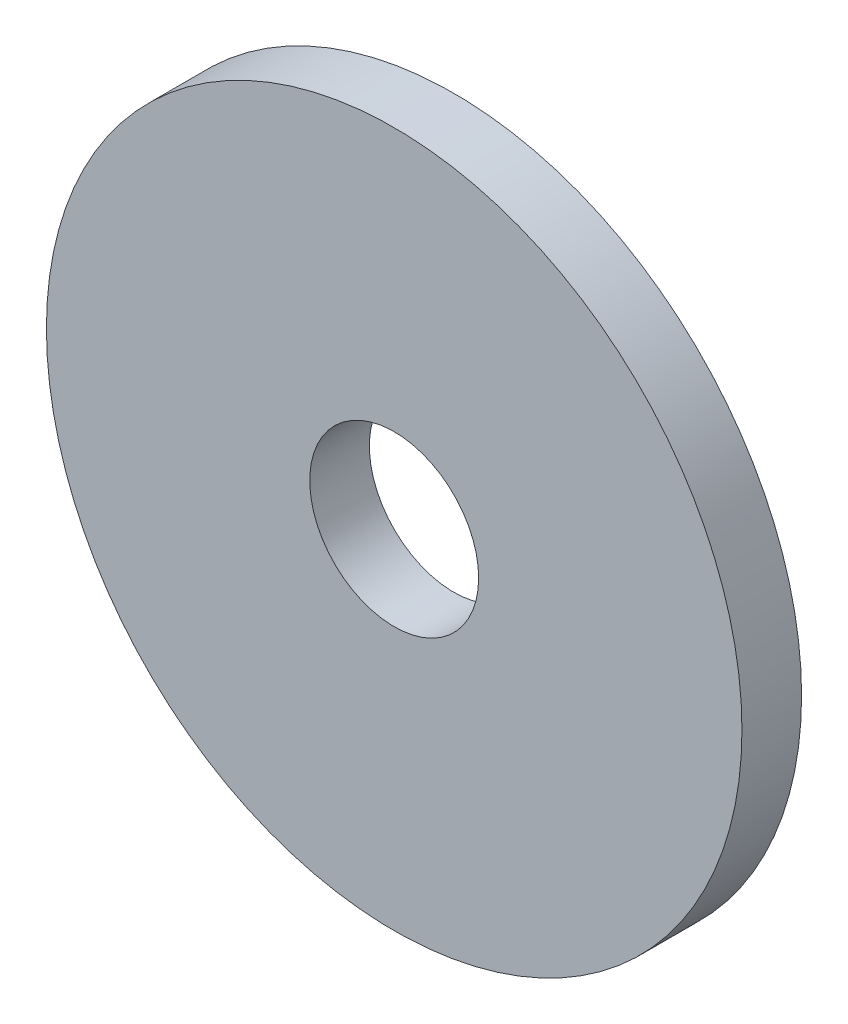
from build123d import *

# Parameters (mm, degrees)
ESQUISSE1_R          = 35
ESQUISSE1_R_2        = 8.5
BASE_EXTRUSION_DEPTH = 6


with BuildPart() as part:
    # Esquisse1 → Base-Extrusion (new body)
    with BuildSketch(Plane.XY):
        Circle(ESQUISSE1_R)
        Circle(ESQUISSE1_R_2, mode=Mode.SUBTRACT)
    extrude(amount=BASE_EXTRUSION_DEPTH)


solid = part.part
